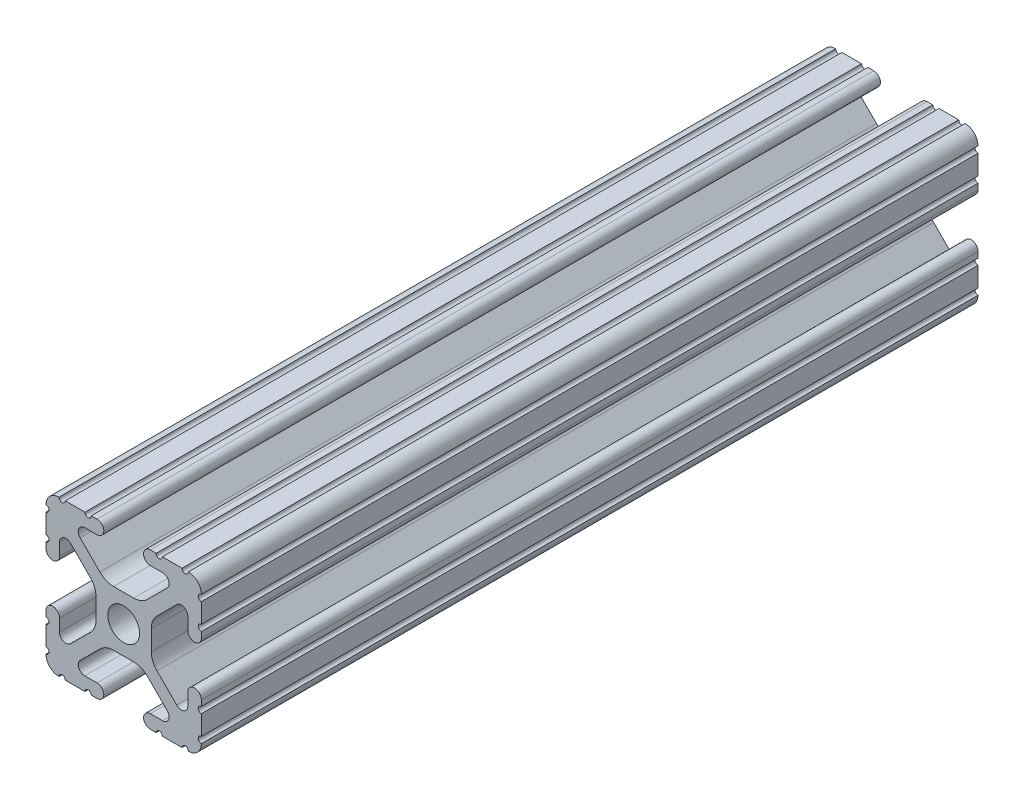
from build123d import *

# Parameters (mm, degrees)
SKETCH1_R      = 2.6035
EXTRUDE1_DEPTH = 127


with BuildPart() as part:
    # Sketch1 → Extrude1 (new body)
    with BuildSketch(Plane.XY):
        with BuildLine():
            Line((10.5918, 12.7), (10.5664, 12.7))
            ThreePointArc((10.5664, 12.7), (10.0584, 12.192), (9.5504, 12.7))
            Line((9.5504, 12.7), (6.3246, 12.7))
            ThreePointArc((6.3246, 12.7), (5.8166, 12.192), (5.3086, 12.7))
            Line((5.3086, 12.7), (4.3561, 12.7))
            ThreePointArc((4.3561, 12.7), (3.2512, 11.5951), (4.3561, 10.4902))
            Line((4.3561, 10.4902), (6.370083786, 10.4902))
            ThreePointArc((6.370083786, 10.4902), (7.348856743, 9.836204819), (7.119204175, 8.681663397))
            Line((7.119204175, 8.681663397), (3.88464389, 5.447103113))
            ThreePointArc((3.88464389, 5.447103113), (2.854599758, 4.758849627), (1.63957986, 4.517167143))
            Line((1.63957986, 4.517167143), (-1.63957986, 4.517167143))
            ThreePointArc((-1.63957986, 4.517167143), (-2.854599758, 4.758849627), (-3.88464389, 5.447103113))
            Line((-3.88464389, 5.447103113), (-7.119204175, 8.681663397))
            ThreePointArc((-7.119204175, 8.681663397), (-7.348856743, 9.836204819), (-6.370083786, 10.4902))
            Line((-6.370083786, 10.4902), (-4.3561, 10.4902))
            ThreePointArc((-4.3561, 10.4902), (-3.2512, 11.5951), (-4.3561, 12.7))
            Line((-4.3561, 12.7), (-5.3086, 12.7))
            ThreePointArc((-5.3086, 12.7), (-5.8166, 12.192), (-6.3246, 12.7))
            Line((-6.3246, 12.7), (-9.5504, 12.7))
            ThreePointArc((-9.5504, 12.7), (-10.0584, 12.192), (-10.5664, 12.7))
            Line((-10.5664, 12.7), (-10.5918, 12.7))
            ThreePointArc((-10.5918, 12.7), (-12.082522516, 12.082522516), (-12.7, 10.5918))
            Line((-12.7, 10.5918), (-12.7, 10.5664))
            ThreePointArc((-12.7, 10.5664), (-12.192, 10.0584), (-12.7, 9.5504))
            Line((-12.7, 9.5504), (-12.7, 6.3246))
            ThreePointArc((-12.7, 6.3246), (-12.192, 5.8166), (-12.7, 5.3086))
            Line((-12.7, 5.3086), (-12.7, 4.3561))
            ThreePointArc((-12.7, 4.3561), (-11.5951, 3.2512), (-10.4902, 4.3561))
            Line((-10.4902, 4.3561), (-10.4902, 6.370083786))
            ThreePointArc((-10.4902, 6.370083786), (-9.836204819, 7.348856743), (-8.681663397, 7.119204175))
            Line((-8.681663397, 7.119204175), (-5.447103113, 3.88464389))
            ThreePointArc((-5.447103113, 3.88464389), (-4.758849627, 2.854599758), (-4.517167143, 1.63957986))
            Line((-4.517167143, 1.63957986), (-4.517167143, -1.63957986))
            ThreePointArc((-4.517167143, -1.63957986), (-4.758849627, -2.854599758), (-5.447103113, -3.88464389))
            Line((-5.447103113, -3.88464389), (-8.681663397, -7.119204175))
            ThreePointArc((-8.681663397, -7.119204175), (-9.836204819, -7.348856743), (-10.4902, -6.370083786))
            Line((-10.4902, -6.370083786), (-10.4902, -4.3561))
            ThreePointArc((-10.4902, -4.3561), (-11.5951, -3.2512), (-12.7, -4.3561))
            Line((-12.7, -4.3561), (-12.7, -5.3086))
            ThreePointArc((-12.7, -5.3086), (-12.192, -5.8166), (-12.7, -6.3246))
            Line((-12.7, -6.3246), (-12.7, -9.5504))
            ThreePointArc((-12.7, -9.5504), (-12.192, -10.0584), (-12.7, -10.5664))
            Line((-12.7, -10.5664), (-12.7, -10.5918))
            ThreePointArc((-12.7, -10.5918), (-12.082522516, -12.082522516), (-10.5918, -12.7))
            Line((-10.5918, -12.7), (-10.5664, -12.7))
            ThreePointArc((-10.5664, -12.7), (-10.0584, -12.192), (-9.5504, -12.7))
            Line((-9.5504, -12.7), (-6.3246, -12.7))
            ThreePointArc((-6.3246, -12.7), (-5.8166, -12.192), (-5.3086, -12.7))
            Line((-5.3086, -12.7), (-4.3561, -12.7))
            ThreePointArc((-4.3561, -12.7), (-3.2512, -11.5951), (-4.3561, -10.4902))
            Line((-4.3561, -10.4902), (-6.370083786, -10.4902))
            ThreePointArc((-6.370083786, -10.4902), (-7.348856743, -9.836204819), (-7.119204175, -8.681663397))
            Line((-7.119204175, -8.681663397), (-3.88464389, -5.447103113))
            ThreePointArc((-3.88464389, -5.447103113), (-2.854599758, -4.758849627), (-1.63957986, -4.517167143))
            Line((-1.63957986, -4.517167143), (1.63957986, -4.517167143))
            ThreePointArc((1.63957986, -4.517167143), (2.854599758, -4.758849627), (3.88464389, -5.447103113))
            Line((3.88464389, -5.447103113), (7.119204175, -8.681663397))
            ThreePointArc((7.119204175, -8.681663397), (7.348856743, -9.836204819), (6.370083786, -10.4902))
            Line((6.370083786, -10.4902), (4.3561, -10.4902))
            ThreePointArc((4.3561, -10.4902), (3.2512, -11.5951), (4.3561, -12.7))
            Line((4.3561, -12.7), (5.3086, -12.7))
            ThreePointArc((5.3086, -12.7), (5.8166, -12.192), (6.3246, -12.7))
            Line((6.3246, -12.7), (9.5504, -12.7))
            ThreePointArc((9.5504, -12.7), (10.0584, -12.192), (10.5664, -12.7))
            Line((10.5664, -12.7), (10.5918, -12.7))
            ThreePointArc((10.5918, -12.7), (12.082522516, -12.082522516), (12.7, -10.5918))
            Line((12.7, -10.5918), (12.7, -10.5664))
            ThreePointArc((12.7, -10.5664), (12.192, -10.0584), (12.7, -9.5504))
            Line((12.7, -9.5504), (12.7, -6.3246))
            ThreePointArc((12.7, -6.3246), (12.192, -5.8166), (12.7, -5.3086))
            Line((12.7, -5.3086), (12.7, -4.3561))
            ThreePointArc((12.7, -4.3561), (11.5951, -3.2512), (10.4902, -4.3561))
            Line((10.4902, -4.3561), (10.4902, -6.370083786))
            ThreePointArc((10.4902, -6.370083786), (9.836204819, -7.348856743), (8.681663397, -7.119204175))
            Line((8.681663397, -7.119204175), (5.447103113, -3.88464389))
            ThreePointArc((5.447103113, -3.88464389), (4.758849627, -2.854599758), (4.517167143, -1.63957986))
            Line((4.517167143, -1.63957986), (4.517167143, 1.63957986))
            ThreePointArc((4.517167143, 1.63957986), (4.758849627, 2.854599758), (5.447103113, 3.88464389))
            Line((5.447103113, 3.88464389), (8.681663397, 7.119204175))
            ThreePointArc((8.681663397, 7.119204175), (9.836204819, 7.348856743), (10.4902, 6.370083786))
            Line((10.4902, 6.370083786), (10.4902, 4.3561))
            ThreePointArc((10.4902, 4.3561), (11.5951, 3.2512), (12.7, 4.3561))
            Line((12.7, 4.3561), (12.7, 5.3086))
            ThreePointArc((12.7, 5.3086), (12.192, 5.8166), (12.7, 6.3246))
            Line((12.7, 6.3246), (12.7, 9.5504))
            ThreePointArc((12.7, 9.5504), (12.192, 10.0584), (12.7, 10.5664))
            Line((12.7, 10.5664), (12.7, 10.5918))
            ThreePointArc((12.7, 10.5918), (12.082522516, 12.082522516), (10.5918, 12.7))
        make_face()
        Circle(SKETCH1_R, mode=Mode.SUBTRACT)
    extrude(amount=-EXTRUDE1_DEPTH)


solid = part.part
